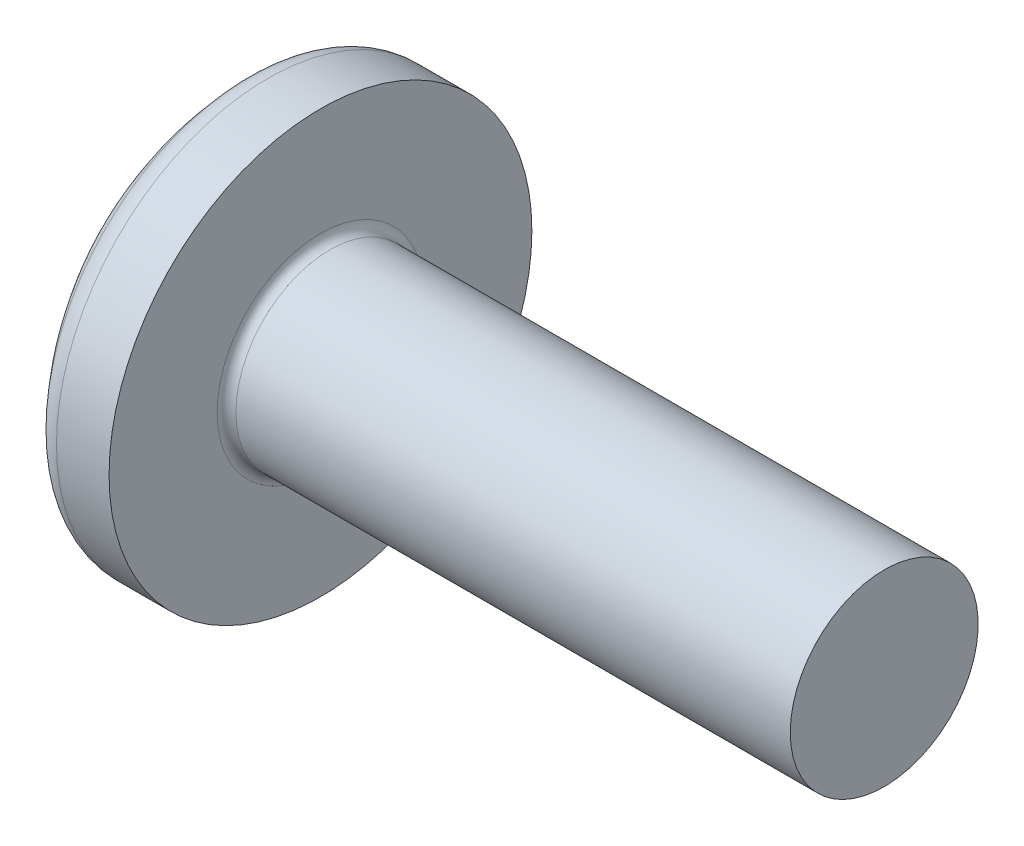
ISO-10303-21;
HEADER;
FILE_DESCRIPTION(('STEP AP214'),'2;1');
FILE_NAME('part.step','',(''),(''),'','','');
FILE_SCHEMA(('AUTOMOTIVE_DESIGN { 1 0 10303 214 1 1 1 1 }'));
ENDSEC;
DATA;
#1=APPLICATION_CONTEXT('core data for automotive mechanical design processes');
#2=APPLICATION_PROTOCOL_DEFINITION('international standard','automotive_design',2000,#1);
#3=PRODUCT_CONTEXT('',#1,'mechanical');
#4=PRODUCT('Part','Part','',(#3));
#5=PRODUCT_RELATED_PRODUCT_CATEGORY('part','',(#4));
#6=PRODUCT_DEFINITION_FORMATION('','',#4);
#7=PRODUCT_DEFINITION_CONTEXT('part definition',#1,'design');
#8=PRODUCT_DEFINITION('design','',#6,#7);
#9=PRODUCT_DEFINITION_SHAPE('','',#8);
#10=(LENGTH_UNIT() NAMED_UNIT(*) SI_UNIT(.MILLI.,.METRE.));
#11=(NAMED_UNIT(*) PLANE_ANGLE_UNIT() SI_UNIT($,.RADIAN.));
#12=(NAMED_UNIT(*) SI_UNIT($,.STERADIAN.) SOLID_ANGLE_UNIT());
#13=UNCERTAINTY_MEASURE_WITH_UNIT(LENGTH_MEASURE(1.E-05),#10,'distance_accuracy_value','');
#14=(GEOMETRIC_REPRESENTATION_CONTEXT(3) GLOBAL_UNCERTAINTY_ASSIGNED_CONTEXT((#13)) GLOBAL_UNIT_ASSIGNED_CONTEXT((#10,
#11,#12)) REPRESENTATION_CONTEXT('',''));
#15=CARTESIAN_POINT('',(0.,0.,0.));
#16=DIRECTION('',(0.,0.,1.));
#17=DIRECTION('',(1.,0.,0.));
#18=AXIS2_PLACEMENT_3D('',#15,#16,#17);
#19=CARTESIAN_POINT('',(3.2,0.,0.));
#20=DIRECTION('',(-1.,0.,0.));
#21=DIRECTION('',(0.,1.,0.));
#22=AXIS2_PLACEMENT_3D('',#19,#20,#21);
#23=SPHERICAL_SURFACE('',#22,3.2);
#24=CARTESIAN_POINT('',(0.841233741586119,0.,0.));
#25=DIRECTION('',(-1.,0.,0.));
#26=DIRECTION('',(0.,0.,1.));
#27=AXIS2_PLACEMENT_3D('',#24,#25,#26);
#28=CIRCLE('',#27,2.16245733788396);
#29=CARTESIAN_POINT('',(0.841233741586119,0.,2.16245733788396));
#30=VERTEX_POINT('',#29);
#31=EDGE_CURVE('E237',#30,#30,#28,.T.);
#32=ORIENTED_EDGE('',*,*,#31,.T.);
#33=EDGE_LOOP('',(#32));
#34=FACE_BOUND('',#33,.T.);
#35=CARTESIAN_POINT('',(0.0716483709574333,0.,0.));
#36=DIRECTION('',(1.,0.,0.));
#37=DIRECTION('',(0.,0.,-1.));
#38=AXIS2_PLACEMENT_3D('',#35,#36,#37);
#39=CIRCLE('',#38,0.673361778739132);
#40=CARTESIAN_POINT('',(0.0716483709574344,-0.369999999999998,-0.562597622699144));
#41=VERTEX_POINT('',#40);
#42=CARTESIAN_POINT('',(0.0716483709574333,-0.56259762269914,-0.37));
#43=VERTEX_POINT('',#42);
#44=EDGE_CURVE('E373',#41,#43,#39,.F.);
#45=ORIENTED_EDGE('',*,*,#44,.F.);
#46=CARTESIAN_POINT('',(3.2,-0.37,0.));
#47=DIRECTION('',(0.,1.,0.));
#48=DIRECTION('',(0.,0.,1.));
#49=AXIS2_PLACEMENT_3D('',#46,#47,#48);
#50=CIRCLE('',#49,3.17853739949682);
#51=CARTESIAN_POINT('',(0.155263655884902,-0.369999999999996,-0.912513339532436));
#52=VERTEX_POINT('',#51);
#53=EDGE_CURVE('E299',#52,#41,#50,.T.);
#54=ORIENTED_EDGE('',*,*,#53,.F.);
#55=CARTESIAN_POINT('',(3.24047110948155,0.,-0.16762475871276));
#56=DIRECTION('',(0.234695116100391,0.,-0.972069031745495));
#57=DIRECTION('',(-0.972069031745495,0.,-0.234695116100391));
#58=AXIS2_PLACEMENT_3D('',#55,#56,#57);
#59=CIRCLE('',#58,3.19535037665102);
#60=CARTESIAN_POINT('',(0.155263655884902,0.370000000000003,-0.912513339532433));
#61=VERTEX_POINT('',#60);
#62=EDGE_CURVE('E271',#52,#61,#59,.T.);
#63=ORIENTED_EDGE('',*,*,#62,.T.);
#64=CARTESIAN_POINT('',(3.2,0.37,0.));
#65=DIRECTION('',(0.,-1.,0.));
#66=DIRECTION('',(0.,0.,-1.));
#67=AXIS2_PLACEMENT_3D('',#64,#65,#66);
#68=CIRCLE('',#67,3.17853739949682);
#69=CARTESIAN_POINT('',(0.0716483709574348,0.370000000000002,-0.562597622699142));
#70=VERTEX_POINT('',#69);
#71=EDGE_CURVE('E326',#70,#61,#68,.T.);
#72=ORIENTED_EDGE('',*,*,#71,.F.);
#73=CARTESIAN_POINT('',(0.0716483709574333,0.562597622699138,-0.37));
#74=VERTEX_POINT('',#73);
#75=EDGE_CURVE('E392',#74,#70,#39,.F.);
#76=ORIENTED_EDGE('',*,*,#75,.F.);
#77=CARTESIAN_POINT('',(3.2,0.,-0.37));
#78=DIRECTION('',(0.,0.,1.));
#79=DIRECTION('',(0.,-1.,0.));
#80=AXIS2_PLACEMENT_3D('',#77,#78,#79);
#81=CIRCLE('',#80,3.17853739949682);
#82=CARTESIAN_POINT('',(0.155263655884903,0.912513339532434,-0.37));
#83=VERTEX_POINT('',#82);
#84=EDGE_CURVE('E265',#83,#74,#81,.T.);
#85=ORIENTED_EDGE('',*,*,#84,.F.);
#86=CARTESIAN_POINT('',(3.24047110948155,0.167624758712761,0.));
#87=DIRECTION('',(0.234695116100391,0.972069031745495,0.));
#88=DIRECTION('',(-0.972069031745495,0.234695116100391,0.));
#89=AXIS2_PLACEMENT_3D('',#86,#87,#88);
#90=CIRCLE('',#89,3.19535037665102);
#91=CARTESIAN_POINT('',(0.155263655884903,0.912513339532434,0.37));
#92=VERTEX_POINT('',#91);
#93=EDGE_CURVE('E268',#83,#92,#90,.T.);
#94=ORIENTED_EDGE('',*,*,#93,.T.);
#95=CARTESIAN_POINT('',(3.2,0.,0.37));
#96=DIRECTION('',(0.,0.,-1.));
#97=DIRECTION('',(0.,1.,0.));
#98=AXIS2_PLACEMENT_3D('',#95,#96,#97);
#99=CIRCLE('',#98,3.17853739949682);
#100=CARTESIAN_POINT('',(0.0716483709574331,0.562597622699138,0.37));
#101=VERTEX_POINT('',#100);
#102=EDGE_CURVE('E261',#101,#92,#99,.T.);
#103=ORIENTED_EDGE('',*,*,#102,.F.);
#104=CARTESIAN_POINT('',(0.0716483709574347,0.369999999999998,0.562597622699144));
#105=VERTEX_POINT('',#104);
#106=EDGE_CURVE('E391',#105,#101,#39,.F.);
#107=ORIENTED_EDGE('',*,*,#106,.F.);
#108=CARTESIAN_POINT('',(0.155263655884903,0.369999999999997,0.912513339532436));
#109=VERTEX_POINT('',#108);
#110=EDGE_CURVE('E281',#109,#105,#68,.T.);
#111=ORIENTED_EDGE('',*,*,#110,.F.);
#112=CARTESIAN_POINT('',(3.24047110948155,0.,0.167624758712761));
#113=DIRECTION('',(0.234695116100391,0.,0.972069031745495));
#114=DIRECTION('',(0.972069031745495,0.,-0.234695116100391));
#115=AXIS2_PLACEMENT_3D('',#112,#113,#114);
#116=CIRCLE('',#115,3.19535037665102);
#117=CARTESIAN_POINT('',(0.155263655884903,-0.370000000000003,0.912513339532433));
#118=VERTEX_POINT('',#117);
#119=EDGE_CURVE('E48',#109,#118,#116,.T.);
#120=ORIENTED_EDGE('',*,*,#119,.T.);
#121=CARTESIAN_POINT('',(0.0716483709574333,-0.370000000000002,0.562597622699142));
#122=VERTEX_POINT('',#121);
#123=EDGE_CURVE('E278',#122,#118,#50,.T.);
#124=ORIENTED_EDGE('',*,*,#123,.F.);
#125=CARTESIAN_POINT('',(0.0716483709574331,-0.562597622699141,0.37));
#126=VERTEX_POINT('',#125);
#127=EDGE_CURVE('E431',#126,#122,#39,.F.);
#128=ORIENTED_EDGE('',*,*,#127,.F.);
#129=CARTESIAN_POINT('',(0.155263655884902,-0.912513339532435,0.37));
#130=VERTEX_POINT('',#129);
#131=EDGE_CURVE('E262',#130,#126,#99,.T.);
#132=ORIENTED_EDGE('',*,*,#131,.F.);
#133=CARTESIAN_POINT('',(3.24047110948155,-0.16762475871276,0.));
#134=DIRECTION('',(0.234695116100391,-0.972069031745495,0.));
#135=DIRECTION('',(0.972069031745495,0.234695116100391,0.));
#136=AXIS2_PLACEMENT_3D('',#133,#134,#135);
#137=CIRCLE('',#136,3.19535037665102);
#138=CARTESIAN_POINT('',(0.155263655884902,-0.912513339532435,-0.37));
#139=VERTEX_POINT('',#138);
#140=EDGE_CURVE('E258',#130,#139,#137,.T.);
#141=ORIENTED_EDGE('',*,*,#140,.T.);
#142=EDGE_CURVE('E63',#43,#139,#81,.T.);
#143=ORIENTED_EDGE('',*,*,#142,.F.);
#144=EDGE_LOOP('',(#45,#54,#63,#72,#76,#85,#94,#103,#107,#111,#120,#124,#128,#132,#141,#143));
#145=FACE_BOUND('',#144,.T.);
#146=ADVANCED_FACE('F34',(#34,#145),#23,.T.);
#147=CARTESIAN_POINT('',(1.75,0.527482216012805,-0.37));
#148=DIRECTION('',(0.,0.,1.));
#149=DIRECTION('',(0.,-1.,0.));
#150=AXIS2_PLACEMENT_3D('',#147,#148,#149);
#151=PLANE('',#150);
#152=ORIENTED_EDGE('',*,*,#84,.T.);
#153=CARTESIAN_POINT('',(-0.971955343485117,0.648166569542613,-0.37));
#154=CARTESIAN_POINT('',(-0.766872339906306,0.631647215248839,-0.37));
#155=CARTESIAN_POINT('',(-0.561800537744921,0.614985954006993,-0.37));
#156=CARTESIAN_POINT('',(-0.151684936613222,0.581268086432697,-0.37));
#157=CARTESIAN_POINT('',(0.0533588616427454,0.564211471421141,-0.37));
#158=CARTESIAN_POINT('',(0.46340379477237,0.529592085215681,-0.37));
#159=CARTESIAN_POINT('',(0.668404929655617,0.512029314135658,-0.37));
#160=CARTESIAN_POINT('',(1.07834476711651,0.476219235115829,-0.37));
#161=CARTESIAN_POINT('',(1.28328347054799,0.457971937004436,-0.37));
#162=CARTESIAN_POINT('',(1.62132593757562,0.427064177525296,-0.37));
#163=CARTESIAN_POINT('',(1.75445532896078,0.414684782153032,-0.37));
#164=CARTESIAN_POINT('',(2.0206619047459,0.38938526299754,-0.37));
#165=CARTESIAN_POINT('',(2.15373908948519,0.376465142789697,-0.37));
#166=CARTESIAN_POINT('',(2.41982964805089,0.349910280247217,-0.37));
#167=CARTESIAN_POINT('',(2.55284301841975,0.336275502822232,-0.37));
#168=CARTESIAN_POINT('',(2.81875830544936,0.307934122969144,-0.37));
#169=CARTESIAN_POINT('',(2.95166021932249,0.293227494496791,-0.37));
#170=CARTESIAN_POINT('',(3.08448262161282,0.277806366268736,-0.37));
#171=B_SPLINE_CURVE_WITH_KNOTS('',3,(#153,#154,#155,#156,#157,#158,#159,#160,#161,#162,#163,
#164,#165,#166,#167,#168,#169,#170),.UNSPECIFIED.,.F.,.F.,(4,2,2,2,2,2,2,2,4),(0.,
0.617242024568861,1.23449761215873,1.85175306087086,2.46899965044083,2.87010992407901,
3.27121754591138,3.67234488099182,4.07348196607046),.UNSPECIFIED.);
#172=CARTESIAN_POINT('',(1.75,0.415013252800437,-0.370000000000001));
#173=VERTEX_POINT('',#172);
#174=EDGE_CURVE('E415',#74,#173,#171,.T.);
#175=ORIENTED_EDGE('',*,*,#174,.T.);
#176=DIRECTION('',(0.,1.,0.));
#177=VECTOR('',#176,1.);
#178=CARTESIAN_POINT('',(1.75,-0.527482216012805,-0.37));
#179=LINE('',#178,#177);
#180=CARTESIAN_POINT('',(1.75,0.527482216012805,-0.37));
#181=VERTEX_POINT('',#180);
#182=EDGE_CURVE('E355',#173,#181,#179,.T.);
#183=ORIENTED_EDGE('',*,*,#182,.T.);
#184=DIRECTION('',(0.972069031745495,-0.234695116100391,0.));
#185=VECTOR('',#184,1.);
#186=CARTESIAN_POINT('',(0.,0.95,-0.37));
#187=LINE('',#186,#185);
#188=EDGE_CURVE('E238',#83,#181,#187,.T.);
#189=ORIENTED_EDGE('',*,*,#188,.F.);
#190=EDGE_LOOP('',(#152,#175,#183,#189));
#191=FACE_BOUND('',#190,.T.);
#192=ADVANCED_FACE('F193',(#191),#151,.T.);
#193=CARTESIAN_POINT('',(1.75,-0.527482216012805,-0.37));
#194=VERTEX_POINT('',#193);
#195=CARTESIAN_POINT('',(1.75,-0.415013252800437,-0.37));
#196=VERTEX_POINT('',#195);
#197=EDGE_CURVE('E246',#194,#196,#179,.T.);
#198=ORIENTED_EDGE('',*,*,#197,.T.);
#199=CARTESIAN_POINT('',(-0.971955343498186,-0.648166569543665,-0.37));
#200=CARTESIAN_POINT('',(-0.766872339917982,-0.631647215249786,-0.37));
#201=CARTESIAN_POINT('',(-0.561800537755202,-0.614985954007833,-0.37));
#202=CARTESIAN_POINT('',(-0.151684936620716,-0.581268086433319,-0.37));
#203=CARTESIAN_POINT('',(0.0533588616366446,-0.564211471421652,-0.37));
#204=CARTESIAN_POINT('',(0.463403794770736,-0.529592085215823,-0.37));
#205=CARTESIAN_POINT('',(0.668404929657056,-0.512029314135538,-0.37));
#206=CARTESIAN_POINT('',(1.0783447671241,-0.476219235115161,-0.37));
#207=CARTESIAN_POINT('',(1.28328347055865,-0.457971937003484,-0.37));
#208=CARTESIAN_POINT('',(1.62132593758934,-0.427064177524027,-0.37));
#209=CARTESIAN_POINT('',(1.75445532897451,-0.414684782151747,-0.37));
#210=CARTESIAN_POINT('',(2.02066190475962,-0.389385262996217,-0.37));
#211=CARTESIAN_POINT('',(2.15373908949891,-0.376465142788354,-0.37));
#212=CARTESIAN_POINT('',(2.4198296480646,-0.349910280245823,-0.37));
#213=CARTESIAN_POINT('',(2.55284301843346,-0.336275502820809,-0.37));
#214=CARTESIAN_POINT('',(2.81875830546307,-0.307934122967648,-0.37));
#215=CARTESIAN_POINT('',(2.95166021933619,-0.293227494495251,-0.37));
#216=CARTESIAN_POINT('',(3.08448262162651,-0.277806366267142,-0.37));
#217=B_SPLINE_CURVE_WITH_KNOTS('',3,(#199,#200,#201,#202,#203,#204,#205,#206,#207,#208,#209,
#210,#211,#212,#213,#214,#215,#216),.UNSPECIFIED.,.F.,.F.,(4,2,2,2,2,2,2,2,4),(0.,
0.617242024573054,1.23449761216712,1.8517530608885,2.46899965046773,2.8701099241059,
3.27121754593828,3.67234488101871,4.07348196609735),.UNSPECIFIED.);
#218=EDGE_CURVE('E390',#196,#43,#217,.F.);
#219=ORIENTED_EDGE('',*,*,#218,.T.);
#220=ORIENTED_EDGE('',*,*,#142,.T.);
#221=DIRECTION('',(0.972069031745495,0.234695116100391,0.));
#222=VECTOR('',#221,1.);
#223=CARTESIAN_POINT('',(0.,-0.95,-0.37));
#224=LINE('',#223,#222);
#225=EDGE_CURVE('E329',#139,#194,#224,.T.);
#226=ORIENTED_EDGE('',*,*,#225,.T.);
#227=EDGE_LOOP('',(#198,#219,#220,#226));
#228=FACE_BOUND('',#227,.T.);
#229=ADVANCED_FACE('F199',(#228),#151,.T.);
#230=CARTESIAN_POINT('',(0.,-0.95,0.37));
#231=DIRECTION('',(0.,0.,-1.));
#232=DIRECTION('',(0.,1.,0.));
#233=AXIS2_PLACEMENT_3D('',#230,#231,#232);
#234=PLANE('',#233);
#235=DIRECTION('',(0.,-1.,0.));
#236=VECTOR('',#235,1.);
#237=CARTESIAN_POINT('',(1.75,0.527482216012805,0.37));
#238=LINE('',#237,#236);
#239=CARTESIAN_POINT('',(1.75,0.527482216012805,0.37));
#240=VERTEX_POINT('',#239);
#241=CARTESIAN_POINT('',(1.75,0.415013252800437,0.37));
#242=VERTEX_POINT('',#241);
#243=EDGE_CURVE('E338',#240,#242,#238,.T.);
#244=ORIENTED_EDGE('',*,*,#243,.T.);
#245=CARTESIAN_POINT('',(-0.971955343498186,0.648166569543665,0.37));
#246=CARTESIAN_POINT('',(-0.766872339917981,0.631647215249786,0.37));
#247=CARTESIAN_POINT('',(-0.561800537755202,0.614985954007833,0.37));
#248=CARTESIAN_POINT('',(-0.151684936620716,0.581268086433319,0.37));
#249=CARTESIAN_POINT('',(0.0533588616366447,0.564211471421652,0.37));
#250=CARTESIAN_POINT('',(0.463403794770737,0.529592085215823,0.37));
#251=CARTESIAN_POINT('',(0.668404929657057,0.512029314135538,0.37));
#252=CARTESIAN_POINT('',(1.0783447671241,0.476219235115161,0.37));
#253=CARTESIAN_POINT('',(1.28328347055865,0.457971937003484,0.37));
#254=CARTESIAN_POINT('',(1.62132593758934,0.427064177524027,0.37));
#255=CARTESIAN_POINT('',(1.75445532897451,0.414684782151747,0.37));
#256=CARTESIAN_POINT('',(2.02066190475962,0.389385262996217,0.37));
#257=CARTESIAN_POINT('',(2.15373908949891,0.376465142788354,0.37));
#258=CARTESIAN_POINT('',(2.4198296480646,0.349910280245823,0.37));
#259=CARTESIAN_POINT('',(2.55284301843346,0.336275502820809,0.37));
#260=CARTESIAN_POINT('',(2.81875830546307,0.307934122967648,0.37));
#261=CARTESIAN_POINT('',(2.95166021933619,0.293227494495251,0.37));
#262=CARTESIAN_POINT('',(3.08448262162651,0.277806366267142,0.37));
#263=B_SPLINE_CURVE_WITH_KNOTS('',3,(#245,#246,#247,#248,#249,#250,#251,#252,#253,#254,#255,
#256,#257,#258,#259,#260,#261,#262),.UNSPECIFIED.,.F.,.F.,(4,2,2,2,2,2,2,2,4),(0.,
0.617242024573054,1.23449761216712,1.8517530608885,2.46899965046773,2.8701099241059,
3.27121754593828,3.67234488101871,4.07348196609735),.UNSPECIFIED.);
#264=EDGE_CURVE('E668',#242,#101,#263,.F.);
#265=ORIENTED_EDGE('',*,*,#264,.T.);
#266=ORIENTED_EDGE('',*,*,#102,.T.);
#267=DIRECTION('',(0.972069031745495,-0.234695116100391,0.));
#268=VECTOR('',#267,1.);
#269=CARTESIAN_POINT('',(0.,0.95,0.37));
#270=LINE('',#269,#268);
#271=EDGE_CURVE('E243',#92,#240,#270,.T.);
#272=ORIENTED_EDGE('',*,*,#271,.T.);
#273=EDGE_LOOP('',(#244,#265,#266,#272));
#274=FACE_BOUND('',#273,.T.);
#275=ADVANCED_FACE('F411',(#274),#234,.T.);
#276=ORIENTED_EDGE('',*,*,#131,.T.);
#277=CARTESIAN_POINT('',(-0.971955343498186,-0.648166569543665,0.37));
#278=CARTESIAN_POINT('',(-0.766872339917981,-0.631647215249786,0.37));
#279=CARTESIAN_POINT('',(-0.561800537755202,-0.614985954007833,0.37));
#280=CARTESIAN_POINT('',(-0.151684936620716,-0.581268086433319,0.37));
#281=CARTESIAN_POINT('',(0.0533588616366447,-0.564211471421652,0.37));
#282=CARTESIAN_POINT('',(0.463403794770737,-0.529592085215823,0.37));
#283=CARTESIAN_POINT('',(0.668404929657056,-0.512029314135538,0.37));
#284=CARTESIAN_POINT('',(1.0783447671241,-0.476219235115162,0.37));
#285=CARTESIAN_POINT('',(1.28328347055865,-0.457971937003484,0.37));
#286=CARTESIAN_POINT('',(1.62132593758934,-0.427064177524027,0.37));
#287=CARTESIAN_POINT('',(1.75445532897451,-0.414684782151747,0.37));
#288=CARTESIAN_POINT('',(2.02066190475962,-0.389385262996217,0.37));
#289=CARTESIAN_POINT('',(2.15373908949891,-0.376465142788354,0.37));
#290=CARTESIAN_POINT('',(2.4198296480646,-0.349910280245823,0.37));
#291=CARTESIAN_POINT('',(2.55284301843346,-0.336275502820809,0.37));
#292=CARTESIAN_POINT('',(2.81875830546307,-0.307934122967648,0.37));
#293=CARTESIAN_POINT('',(2.95166021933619,-0.293227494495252,0.37));
#294=CARTESIAN_POINT('',(3.08448262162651,-0.277806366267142,0.37));
#295=B_SPLINE_CURVE_WITH_KNOTS('',3,(#277,#278,#279,#280,#281,#282,#283,#284,#285,#286,#287,
#288,#289,#290,#291,#292,#293,#294),.UNSPECIFIED.,.F.,.F.,(4,2,2,2,2,2,2,2,4),(0.,
0.617242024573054,1.23449761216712,1.8517530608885,2.46899965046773,2.8701099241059,
3.27121754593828,3.67234488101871,4.07348196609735),.UNSPECIFIED.);
#296=CARTESIAN_POINT('',(1.75,-0.415013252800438,0.37));
#297=VERTEX_POINT('',#296);
#298=EDGE_CURVE('E432',#126,#297,#295,.T.);
#299=ORIENTED_EDGE('',*,*,#298,.T.);
#300=CARTESIAN_POINT('',(1.75,-0.527482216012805,0.37));
#301=VERTEX_POINT('',#300);
#302=EDGE_CURVE('E340',#297,#301,#238,.T.);
#303=ORIENTED_EDGE('',*,*,#302,.T.);
#304=DIRECTION('',(0.972069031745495,0.234695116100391,0.));
#305=VECTOR('',#304,1.);
#306=CARTESIAN_POINT('',(0.,-0.95,0.37));
#307=LINE('',#306,#305);
#308=EDGE_CURVE('E331',#130,#301,#307,.T.);
#309=ORIENTED_EDGE('',*,*,#308,.F.);
#310=EDGE_LOOP('',(#276,#299,#303,#309));
#311=FACE_BOUND('',#310,.T.);
#312=ADVANCED_FACE('F524',(#311),#234,.T.);
#313=CARTESIAN_POINT('',(1.75,0.527482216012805,0.37));
#314=DIRECTION('',(0.234695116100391,0.972069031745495,0.));
#315=DIRECTION('',(-0.972069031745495,0.234695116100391,0.));
#316=AXIS2_PLACEMENT_3D('',#313,#314,#315);
#317=PLANE('',#316);
#318=CARTESIAN_POINT('',(3.40675133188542,0.127478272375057,0.));
#319=DIRECTION('',(0.234695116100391,0.972069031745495,0.));
#320=DIRECTION('',(-0.972069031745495,0.234695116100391,0.));
#321=AXIS2_PLACEMENT_3D('',#318,#319,#320);
#322=ELLIPSE('',#321,1.87540613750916,0.421283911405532);
#323=CARTESIAN_POINT('',(1.75,0.527482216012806,0.175779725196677));
#324=VERTEX_POINT('',#323);
#325=CARTESIAN_POINT('',(1.75,0.527482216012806,-0.175779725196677));
#326=VERTEX_POINT('',#325);
#327=EDGE_CURVE('E304',#324,#326,#322,.F.);
#328=ORIENTED_EDGE('',*,*,#327,.F.);
#329=DIRECTION('',(0.,0.,-1.));
#330=VECTOR('',#329,1.);
#331=CARTESIAN_POINT('',(1.75,0.527482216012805,0.37));
#332=LINE('',#331,#330);
#333=EDGE_CURVE('E341',#240,#324,#332,.T.);
#334=ORIENTED_EDGE('',*,*,#333,.F.);
#335=ORIENTED_EDGE('',*,*,#271,.F.);
#336=ORIENTED_EDGE('',*,*,#93,.F.);
#337=ORIENTED_EDGE('',*,*,#188,.T.);
#338=EDGE_CURVE('E343',#326,#181,#332,.T.);
#339=ORIENTED_EDGE('',*,*,#338,.F.);
#340=EDGE_LOOP('',(#328,#334,#335,#336,#337,#339));
#341=FACE_BOUND('',#340,.T.);
#342=ADVANCED_FACE('F409',(#341),#317,.F.);
#343=CARTESIAN_POINT('',(1.75,-0.527482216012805,-0.37));
#344=DIRECTION('',(0.234695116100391,-0.972069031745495,0.));
#345=DIRECTION('',(0.972069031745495,0.234695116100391,0.));
#346=AXIS2_PLACEMENT_3D('',#343,#344,#345);
#347=PLANE('',#346);
#348=CARTESIAN_POINT('',(3.40675133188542,-0.127478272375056,0.));
#349=DIRECTION('',(0.234695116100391,-0.972069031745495,0.));
#350=DIRECTION('',(-0.972069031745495,-0.234695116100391,0.));
#351=AXIS2_PLACEMENT_3D('',#348,#349,#350);
#352=ELLIPSE('',#351,1.87540613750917,0.421283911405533);
#353=CARTESIAN_POINT('',(1.75,-0.527482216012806,-0.175779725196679));
#354=VERTEX_POINT('',#353);
#355=CARTESIAN_POINT('',(1.75,-0.527482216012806,0.175779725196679));
#356=VERTEX_POINT('',#355);
#357=EDGE_CURVE('E670',#354,#356,#352,.F.);
#358=ORIENTED_EDGE('',*,*,#357,.F.);
#359=DIRECTION('',(0.,0.,1.));
#360=VECTOR('',#359,1.);
#361=CARTESIAN_POINT('',(1.75,-0.527482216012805,-0.37));
#362=LINE('',#361,#360);
#363=EDGE_CURVE('E334',#194,#354,#362,.T.);
#364=ORIENTED_EDGE('',*,*,#363,.F.);
#365=ORIENTED_EDGE('',*,*,#225,.F.);
#366=ORIENTED_EDGE('',*,*,#140,.F.);
#367=ORIENTED_EDGE('',*,*,#308,.T.);
#368=EDGE_CURVE('E337',#356,#301,#362,.T.);
#369=ORIENTED_EDGE('',*,*,#368,.F.);
#370=EDGE_LOOP('',(#358,#364,#365,#366,#367,#369));
#371=FACE_BOUND('',#370,.T.);
#372=ADVANCED_FACE('F511',(#371),#347,.F.);
#373=CARTESIAN_POINT('',(1.75,0.527482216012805,-0.37));
#374=DIRECTION('',(-1.,0.,0.));
#375=DIRECTION('',(0.,0.,1.));
#376=AXIS2_PLACEMENT_3D('',#373,#374,#375);
#377=PLANE('',#376);
#378=DIRECTION('',(0.,1.,0.));
#379=VECTOR('',#378,1.);
#380=CARTESIAN_POINT('',(1.75,-0.370000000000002,0.527482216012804));
#381=LINE('',#380,#379);
#382=CARTESIAN_POINT('',(1.75,-0.370000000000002,0.527482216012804));
#383=VERTEX_POINT('',#382);
#384=CARTESIAN_POINT('',(1.75,-0.175779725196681,0.527482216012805));
#385=VERTEX_POINT('',#384);
#386=EDGE_CURVE('E319',#383,#385,#381,.T.);
#387=ORIENTED_EDGE('',*,*,#386,.T.);
#388=CARTESIAN_POINT('',(1.75,0.,0.));
#389=DIRECTION('',(-1.,0.,0.));
#390=DIRECTION('',(0.,0.,1.));
#391=AXIS2_PLACEMENT_3D('',#388,#389,#390);
#392=CIRCLE('',#391,0.556);
#393=CARTESIAN_POINT('',(1.75,-0.370000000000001,0.415013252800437));
#394=VERTEX_POINT('',#393);
#395=EDGE_CURVE('E698',#394,#385,#392,.T.);
#396=ORIENTED_EDGE('',*,*,#395,.F.);
#397=DIRECTION('',(0.,0.,-1.));
#398=VECTOR('',#397,1.);
#399=CARTESIAN_POINT('',(1.75,-0.370000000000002,0.527482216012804));
#400=LINE('',#399,#398);
#401=EDGE_CURVE('E315',#383,#394,#400,.T.);
#402=ORIENTED_EDGE('',*,*,#401,.F.);
#403=EDGE_LOOP('',(#387,#396,#402));
#404=FACE_BOUND('',#403,.T.);
#405=ADVANCED_FACE('F468',(#404),#377,.T.);
#406=ORIENTED_EDGE('',*,*,#302,.F.);
#407=EDGE_CURVE('E703',#356,#297,#392,.T.);
#408=ORIENTED_EDGE('',*,*,#407,.F.);
#409=ORIENTED_EDGE('',*,*,#368,.T.);
#410=EDGE_LOOP('',(#406,#408,#409));
#411=FACE_BOUND('',#410,.T.);
#412=ADVANCED_FACE('F498',(#411),#377,.T.);
#413=ORIENTED_EDGE('',*,*,#363,.T.);
#414=EDGE_CURVE('E384',#196,#354,#392,.T.);
#415=ORIENTED_EDGE('',*,*,#414,.F.);
#416=ORIENTED_EDGE('',*,*,#197,.F.);
#417=EDGE_LOOP('',(#413,#415,#416));
#418=FACE_BOUND('',#417,.T.);
#419=ADVANCED_FACE('F492',(#418),#377,.T.);
#420=CARTESIAN_POINT('',(1.75,-0.369999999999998,-0.415013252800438));
#421=VERTEX_POINT('',#420);
#422=CARTESIAN_POINT('',(1.75,-0.369999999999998,-0.527482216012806));
#423=VERTEX_POINT('',#422);
#424=EDGE_CURVE('E318',#421,#423,#400,.T.);
#425=ORIENTED_EDGE('',*,*,#424,.F.);
#426=CARTESIAN_POINT('',(1.75,-0.175779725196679,-0.527482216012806));
#427=VERTEX_POINT('',#426);
#428=EDGE_CURVE('E55',#427,#421,#392,.T.);
#429=ORIENTED_EDGE('',*,*,#428,.F.);
#430=DIRECTION('',(0.,-1.,0.));
#431=VECTOR('',#430,1.);
#432=CARTESIAN_POINT('',(1.75,0.370000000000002,-0.527482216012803));
#433=LINE('',#432,#431);
#434=EDGE_CURVE('E314',#427,#423,#433,.T.);
#435=ORIENTED_EDGE('',*,*,#434,.T.);
#436=EDGE_LOOP('',(#425,#429,#435));
#437=FACE_BOUND('',#436,.T.);
#438=ADVANCED_FACE('F379',(#437),#377,.T.);
#439=CARTESIAN_POINT('',(1.75,0.370000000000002,-0.527482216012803));
#440=VERTEX_POINT('',#439);
#441=CARTESIAN_POINT('',(1.75,0.175779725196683,-0.527482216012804));
#442=VERTEX_POINT('',#441);
#443=EDGE_CURVE('E311',#440,#442,#433,.T.);
#444=ORIENTED_EDGE('',*,*,#443,.T.);
#445=CARTESIAN_POINT('',(1.75,0.370000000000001,-0.415013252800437));
#446=VERTEX_POINT('',#445);
#447=EDGE_CURVE('E383',#446,#442,#392,.T.);
#448=ORIENTED_EDGE('',*,*,#447,.F.);
#449=DIRECTION('',(0.,0.,1.));
#450=VECTOR('',#449,1.);
#451=CARTESIAN_POINT('',(1.75,0.370000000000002,-0.527482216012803));
#452=LINE('',#451,#450);
#453=EDGE_CURVE('E323',#440,#446,#452,.T.);
#454=ORIENTED_EDGE('',*,*,#453,.F.);
#455=EDGE_LOOP('',(#444,#448,#454));
#456=FACE_BOUND('',#455,.T.);
#457=ADVANCED_FACE('F480',(#456),#377,.T.);
#458=ORIENTED_EDGE('',*,*,#182,.F.);
#459=EDGE_CURVE('E687',#326,#173,#392,.T.);
#460=ORIENTED_EDGE('',*,*,#459,.F.);
#461=ORIENTED_EDGE('',*,*,#338,.T.);
#462=EDGE_LOOP('',(#458,#460,#461));
#463=FACE_BOUND('',#462,.T.);
#464=ADVANCED_FACE('F474',(#463),#377,.T.);
#465=ORIENTED_EDGE('',*,*,#333,.T.);
#466=EDGE_CURVE('E689',#242,#324,#392,.T.);
#467=ORIENTED_EDGE('',*,*,#466,.F.);
#468=ORIENTED_EDGE('',*,*,#243,.F.);
#469=EDGE_LOOP('',(#465,#467,#468));
#470=FACE_BOUND('',#469,.T.);
#471=ADVANCED_FACE('F466',(#470),#377,.T.);
#472=CARTESIAN_POINT('',(1.75,0.369999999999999,0.415013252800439));
#473=VERTEX_POINT('',#472);
#474=CARTESIAN_POINT('',(1.75,0.369999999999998,0.527482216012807));
#475=VERTEX_POINT('',#474);
#476=EDGE_CURVE('E296',#473,#475,#452,.T.);
#477=ORIENTED_EDGE('',*,*,#476,.F.);
#478=CARTESIAN_POINT('',(1.75,0.175779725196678,0.527482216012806));
#479=VERTEX_POINT('',#478);
#480=EDGE_CURVE('E385',#479,#473,#392,.T.);
#481=ORIENTED_EDGE('',*,*,#480,.F.);
#482=EDGE_CURVE('E322',#479,#475,#381,.T.);
#483=ORIENTED_EDGE('',*,*,#482,.T.);
#484=EDGE_LOOP('',(#477,#481,#483));
#485=FACE_BOUND('',#484,.T.);
#486=ADVANCED_FACE('F460',(#485),#377,.T.);
#487=CARTESIAN_POINT('',(1.75,0.369999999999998,0.527482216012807));
#488=DIRECTION('',(0.,-1.,0.));
#489=DIRECTION('',(0.,0.,-1.));
#490=AXIS2_PLACEMENT_3D('',#487,#488,#489);
#491=PLANE('',#490);
#492=ORIENTED_EDGE('',*,*,#110,.T.);
#493=CARTESIAN_POINT('',(-0.971955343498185,0.369999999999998,0.648166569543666));
#494=CARTESIAN_POINT('',(-0.766872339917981,0.369999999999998,0.631647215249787));
#495=CARTESIAN_POINT('',(-0.561800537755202,0.369999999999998,0.614985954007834));
#496=CARTESIAN_POINT('',(-0.151684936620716,0.369999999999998,0.58126808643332));
#497=CARTESIAN_POINT('',(0.0533588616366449,0.369999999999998,0.564211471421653));
#498=CARTESIAN_POINT('',(0.463403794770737,0.369999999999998,0.529592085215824));
#499=CARTESIAN_POINT('',(0.668404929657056,0.369999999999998,0.512029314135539));
#500=CARTESIAN_POINT('',(1.0783447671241,0.369999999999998,0.476219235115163));
#501=CARTESIAN_POINT('',(1.28328347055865,0.369999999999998,0.457971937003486));
#502=CARTESIAN_POINT('',(1.62132593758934,0.369999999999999,0.427064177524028));
#503=CARTESIAN_POINT('',(1.75445532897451,0.369999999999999,0.414684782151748));
#504=CARTESIAN_POINT('',(2.02066190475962,0.369999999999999,0.389385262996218));
#505=CARTESIAN_POINT('',(2.15373908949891,0.369999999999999,0.376465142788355));
#506=CARTESIAN_POINT('',(2.4198296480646,0.369999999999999,0.349910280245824));
#507=CARTESIAN_POINT('',(2.55284301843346,0.369999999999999,0.33627550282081));
#508=CARTESIAN_POINT('',(2.81875830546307,0.369999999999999,0.307934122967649));
#509=CARTESIAN_POINT('',(2.95166021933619,0.369999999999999,0.293227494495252));
#510=CARTESIAN_POINT('',(3.08448262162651,0.369999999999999,0.277806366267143));
#511=B_SPLINE_CURVE_WITH_KNOTS('',3,(#493,#494,#495,#496,#497,#498,#499,#500,#501,#502,#503,
#504,#505,#506,#507,#508,#509,#510),.UNSPECIFIED.,.F.,.F.,(4,2,2,2,2,2,2,2,4),(0.,
0.617242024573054,1.23449761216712,1.8517530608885,2.46899965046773,2.8701099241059,
3.27121754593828,3.67234488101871,4.07348196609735),.UNSPECIFIED.);
#512=EDGE_CURVE('E667',#105,#473,#511,.T.);
#513=ORIENTED_EDGE('',*,*,#512,.T.);
#514=ORIENTED_EDGE('',*,*,#476,.T.);
#515=DIRECTION('',(0.972069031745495,0.,-0.234695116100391));
#516=VECTOR('',#515,1.);
#517=CARTESIAN_POINT('',(0.,0.369999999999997,0.950000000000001));
#518=LINE('',#517,#516);
#519=EDGE_CURVE('E289',#109,#475,#518,.T.);
#520=ORIENTED_EDGE('',*,*,#519,.F.);
#521=EDGE_LOOP('',(#492,#513,#514,#520));
#522=FACE_BOUND('',#521,.T.);
#523=ADVANCED_FACE('F293',(#522),#491,.T.);
#524=CARTESIAN_POINT('',(0.,-0.369999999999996,-0.950000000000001));
#525=DIRECTION('',(0.,1.,0.));
#526=DIRECTION('',(0.,0.,1.));
#527=AXIS2_PLACEMENT_3D('',#524,#525,#526);
#528=PLANE('',#527);
#529=ORIENTED_EDGE('',*,*,#401,.T.);
#530=CARTESIAN_POINT('',(-0.971955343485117,-0.370000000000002,0.648166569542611));
#531=CARTESIAN_POINT('',(-0.766872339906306,-0.370000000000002,0.631647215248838));
#532=CARTESIAN_POINT('',(-0.561800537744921,-0.370000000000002,0.614985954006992));
#533=CARTESIAN_POINT('',(-0.151684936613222,-0.370000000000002,0.581268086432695));
#534=CARTESIAN_POINT('',(0.0533588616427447,-0.370000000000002,0.56421147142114));
#535=CARTESIAN_POINT('',(0.46340379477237,-0.370000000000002,0.529592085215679));
#536=CARTESIAN_POINT('',(0.668404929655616,-0.370000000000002,0.512029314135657));
#537=CARTESIAN_POINT('',(1.07834476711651,-0.370000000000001,0.476219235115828));
#538=CARTESIAN_POINT('',(1.28328347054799,-0.370000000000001,0.457971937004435));
#539=CARTESIAN_POINT('',(1.62132593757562,-0.370000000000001,0.427064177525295));
#540=CARTESIAN_POINT('',(1.75445532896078,-0.370000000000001,0.414684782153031));
#541=CARTESIAN_POINT('',(2.0206619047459,-0.370000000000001,0.389385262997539));
#542=CARTESIAN_POINT('',(2.15373908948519,-0.370000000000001,0.376465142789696));
#543=CARTESIAN_POINT('',(2.41982964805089,-0.370000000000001,0.349910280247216));
#544=CARTESIAN_POINT('',(2.55284301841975,-0.370000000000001,0.336275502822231));
#545=CARTESIAN_POINT('',(2.81875830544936,-0.370000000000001,0.307934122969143));
#546=CARTESIAN_POINT('',(2.95166021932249,-0.370000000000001,0.29322749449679));
#547=CARTESIAN_POINT('',(3.08448262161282,-0.370000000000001,0.277806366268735));
#548=B_SPLINE_CURVE_WITH_KNOTS('',3,(#530,#531,#532,#533,#534,#535,#536,#537,#538,#539,#540,
#541,#542,#543,#544,#545,#546,#547),.UNSPECIFIED.,.F.,.F.,(4,2,2,2,2,2,2,2,4),(0.,
0.617242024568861,1.23449761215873,1.85175306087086,2.46899965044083,2.87010992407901,
3.27121754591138,3.67234488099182,4.07348196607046),.UNSPECIFIED.);
#549=EDGE_CURVE('E424',#394,#122,#548,.F.);
#550=ORIENTED_EDGE('',*,*,#549,.T.);
#551=ORIENTED_EDGE('',*,*,#123,.T.);
#552=DIRECTION('',(0.972069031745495,0.,-0.234695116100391));
#553=VECTOR('',#552,1.);
#554=CARTESIAN_POINT('',(0.,-0.370000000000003,0.949999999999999));
#555=LINE('',#554,#553);
#556=EDGE_CURVE('E291',#118,#383,#555,.T.);
#557=ORIENTED_EDGE('',*,*,#556,.T.);
#558=EDGE_LOOP('',(#529,#550,#551,#557));
#559=FACE_BOUND('',#558,.T.);
#560=ADVANCED_FACE('F228',(#559),#528,.T.);
#561=CARTESIAN_POINT('',(1.75,-0.370000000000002,0.527482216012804));
#562=DIRECTION('',(0.234695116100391,0.,0.972069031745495));
#563=DIRECTION('',(-0.972069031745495,0.,0.234695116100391));
#564=AXIS2_PLACEMENT_3D('',#561,#562,#563);
#565=PLANE('',#564);
#566=CARTESIAN_POINT('',(3.40675133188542,0.,0.127478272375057));
#567=DIRECTION('',(0.234695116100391,0.,0.972069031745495));
#568=DIRECTION('',(-0.972069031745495,0.,0.234695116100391));
#569=AXIS2_PLACEMENT_3D('',#566,#567,#568);
#570=ELLIPSE('',#569,1.87540613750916,0.421283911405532);
#571=EDGE_CURVE('E422',#385,#479,#570,.F.);
#572=ORIENTED_EDGE('',*,*,#571,.F.);
#573=ORIENTED_EDGE('',*,*,#386,.F.);
#574=ORIENTED_EDGE('',*,*,#556,.F.);
#575=ORIENTED_EDGE('',*,*,#119,.F.);
#576=ORIENTED_EDGE('',*,*,#519,.T.);
#577=ORIENTED_EDGE('',*,*,#482,.F.);
#578=EDGE_LOOP('',(#572,#573,#574,#575,#576,#577));
#579=FACE_BOUND('',#578,.T.);
#580=ADVANCED_FACE('F287',(#579),#565,.F.);
#581=CARTESIAN_POINT('',(1.75,0.370000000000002,-0.527482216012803));
#582=DIRECTION('',(0.234695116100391,0.,-0.972069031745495));
#583=DIRECTION('',(0.972069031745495,0.,0.234695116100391));
#584=AXIS2_PLACEMENT_3D('',#581,#582,#583);
#585=PLANE('',#584);
#586=CARTESIAN_POINT('',(3.40675133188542,0.,-0.127478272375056));
#587=DIRECTION('',(0.234695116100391,0.,-0.972069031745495));
#588=DIRECTION('',(-0.972069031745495,0.,-0.234695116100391));
#589=AXIS2_PLACEMENT_3D('',#586,#587,#588);
#590=ELLIPSE('',#589,1.87540613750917,0.421283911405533);
#591=EDGE_CURVE('E377',#442,#427,#590,.F.);
#592=ORIENTED_EDGE('',*,*,#591,.F.);
#593=ORIENTED_EDGE('',*,*,#443,.F.);
#594=DIRECTION('',(0.972069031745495,0.,0.234695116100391));
#595=VECTOR('',#594,1.);
#596=CARTESIAN_POINT('',(0.,0.370000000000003,-0.949999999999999));
#597=LINE('',#596,#595);
#598=EDGE_CURVE('E301',#61,#440,#597,.T.);
#599=ORIENTED_EDGE('',*,*,#598,.F.);
#600=ORIENTED_EDGE('',*,*,#62,.F.);
#601=DIRECTION('',(0.972069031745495,0.,0.234695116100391));
#602=VECTOR('',#601,1.);
#603=CARTESIAN_POINT('',(0.,-0.369999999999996,-0.950000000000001));
#604=LINE('',#603,#602);
#605=EDGE_CURVE('E308',#52,#423,#604,.T.);
#606=ORIENTED_EDGE('',*,*,#605,.T.);
#607=ORIENTED_EDGE('',*,*,#434,.F.);
#608=EDGE_LOOP('',(#592,#593,#599,#600,#606,#607));
#609=FACE_BOUND('',#608,.T.);
#610=ADVANCED_FACE('F368',(#609),#585,.F.);
#611=ORIENTED_EDGE('',*,*,#453,.T.);
#612=CARTESIAN_POINT('',(-0.971955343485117,0.370000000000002,-0.648166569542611));
#613=CARTESIAN_POINT('',(-0.766872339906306,0.370000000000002,-0.631647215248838));
#614=CARTESIAN_POINT('',(-0.561800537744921,0.370000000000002,-0.614985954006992));
#615=CARTESIAN_POINT('',(-0.151684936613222,0.370000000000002,-0.581268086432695));
#616=CARTESIAN_POINT('',(0.0533588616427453,0.370000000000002,-0.56421147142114));
#617=CARTESIAN_POINT('',(0.46340379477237,0.370000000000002,-0.529592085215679));
#618=CARTESIAN_POINT('',(0.668404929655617,0.370000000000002,-0.512029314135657));
#619=CARTESIAN_POINT('',(1.07834476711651,0.370000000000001,-0.476219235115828));
#620=CARTESIAN_POINT('',(1.28328347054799,0.370000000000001,-0.457971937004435));
#621=CARTESIAN_POINT('',(1.62132593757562,0.370000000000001,-0.427064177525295));
#622=CARTESIAN_POINT('',(1.75445532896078,0.370000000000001,-0.414684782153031));
#623=CARTESIAN_POINT('',(2.0206619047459,0.370000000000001,-0.389385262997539));
#624=CARTESIAN_POINT('',(2.15373908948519,0.370000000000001,-0.376465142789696));
#625=CARTESIAN_POINT('',(2.41982964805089,0.370000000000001,-0.349910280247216));
#626=CARTESIAN_POINT('',(2.55284301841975,0.370000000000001,-0.336275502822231));
#627=CARTESIAN_POINT('',(2.81875830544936,0.370000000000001,-0.307934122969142));
#628=CARTESIAN_POINT('',(2.95166021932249,0.370000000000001,-0.29322749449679));
#629=CARTESIAN_POINT('',(3.08448262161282,0.370000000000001,-0.277806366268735));
#630=B_SPLINE_CURVE_WITH_KNOTS('',3,(#612,#613,#614,#615,#616,#617,#618,#619,#620,#621,#622,
#623,#624,#625,#626,#627,#628,#629),.UNSPECIFIED.,.F.,.F.,(4,2,2,2,2,2,2,2,4),(0.,
0.617242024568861,1.23449761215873,1.85175306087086,2.46899965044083,2.87010992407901,
3.27121754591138,3.67234488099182,4.07348196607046),.UNSPECIFIED.);
#631=EDGE_CURVE('E364',#446,#70,#630,.F.);
#632=ORIENTED_EDGE('',*,*,#631,.T.);
#633=ORIENTED_EDGE('',*,*,#71,.T.);
#634=ORIENTED_EDGE('',*,*,#598,.T.);
#635=EDGE_LOOP('',(#611,#632,#633,#634));
#636=FACE_BOUND('',#635,.T.);
#637=ADVANCED_FACE('F226',(#636),#491,.T.);
#638=ORIENTED_EDGE('',*,*,#53,.T.);
#639=CARTESIAN_POINT('',(-0.971955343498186,-0.369999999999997,-0.648166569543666));
#640=CARTESIAN_POINT('',(-0.766872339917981,-0.369999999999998,-0.631647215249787));
#641=CARTESIAN_POINT('',(-0.561800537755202,-0.369999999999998,-0.614985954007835));
#642=CARTESIAN_POINT('',(-0.151684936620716,-0.369999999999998,-0.58126808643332));
#643=CARTESIAN_POINT('',(0.0533588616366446,-0.369999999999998,-0.564211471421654));
#644=CARTESIAN_POINT('',(0.463403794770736,-0.369999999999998,-0.529592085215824));
#645=CARTESIAN_POINT('',(0.668404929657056,-0.369999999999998,-0.512029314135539));
#646=CARTESIAN_POINT('',(1.0783447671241,-0.369999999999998,-0.476219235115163));
#647=CARTESIAN_POINT('',(1.28328347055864,-0.369999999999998,-0.457971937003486));
#648=CARTESIAN_POINT('',(1.62132593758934,-0.369999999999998,-0.427064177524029));
#649=CARTESIAN_POINT('',(1.75445532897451,-0.369999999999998,-0.414684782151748));
#650=CARTESIAN_POINT('',(2.02066190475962,-0.369999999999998,-0.389385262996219));
#651=CARTESIAN_POINT('',(2.15373908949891,-0.369999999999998,-0.376465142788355));
#652=CARTESIAN_POINT('',(2.4198296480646,-0.369999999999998,-0.349910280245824));
#653=CARTESIAN_POINT('',(2.55284301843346,-0.369999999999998,-0.33627550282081));
#654=CARTESIAN_POINT('',(2.81875830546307,-0.369999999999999,-0.307934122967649));
#655=CARTESIAN_POINT('',(2.95166021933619,-0.369999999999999,-0.293227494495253));
#656=CARTESIAN_POINT('',(3.08448262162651,-0.369999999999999,-0.277806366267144));
#657=B_SPLINE_CURVE_WITH_KNOTS('',3,(#639,#640,#641,#642,#643,#644,#645,#646,#647,#648,#649,
#650,#651,#652,#653,#654,#655,#656),.UNSPECIFIED.,.F.,.F.,(4,2,2,2,2,2,2,2,4),(0.,
0.617242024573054,1.23449761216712,1.8517530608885,2.46899965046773,2.8701099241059,
3.27121754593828,3.67234488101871,4.07348196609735),.UNSPECIFIED.);
#658=EDGE_CURVE('E11',#41,#421,#657,.T.);
#659=ORIENTED_EDGE('',*,*,#658,.T.);
#660=ORIENTED_EDGE('',*,*,#424,.T.);
#661=ORIENTED_EDGE('',*,*,#605,.F.);
#662=EDGE_LOOP('',(#638,#659,#660,#661));
#663=FACE_BOUND('',#662,.T.);
#664=ADVANCED_FACE('F221',(#663),#528,.T.);
#665=CARTESIAN_POINT('',(-25.4,0.,0.));
#666=DIRECTION('',(-1.,0.,0.));
#667=DIRECTION('',(0.,0.,1.));
#668=AXIS2_PLACEMENT_3D('',#665,#666,#667);
#669=CYLINDRICAL_SURFACE('',#668,1.);
#670=CARTESIAN_POINT('',(1.7,0.,0.));
#671=DIRECTION('',(-1.,0.,0.));
#672=DIRECTION('',(0.,0.,1.));
#673=AXIS2_PLACEMENT_3D('',#670,#671,#672);
#674=CIRCLE('',#673,1.);
#675=CARTESIAN_POINT('',(1.7,0.,1.));
#676=VERTEX_POINT('',#675);
#677=EDGE_CURVE('E232',#676,#676,#674,.F.);
#678=ORIENTED_EDGE('',*,*,#677,.T.);
#679=EDGE_LOOP('',(#678));
#680=FACE_BOUND('',#679,.T.);
#681=CARTESIAN_POINT('',(7.6,0.,0.));
#682=DIRECTION('',(-1.,0.,0.));
#683=DIRECTION('',(0.,0.,1.));
#684=AXIS2_PLACEMENT_3D('',#681,#682,#683);
#685=CIRCLE('',#684,1.);
#686=CARTESIAN_POINT('',(7.6,0.,1.));
#687=VERTEX_POINT('',#686);
#688=EDGE_CURVE('E235',#687,#687,#685,.T.);
#689=ORIENTED_EDGE('',*,*,#688,.T.);
#690=EDGE_LOOP('',(#689));
#691=FACE_BOUND('',#690,.T.);
#692=ADVANCED_FACE('F218',(#680,#691),#669,.T.);
#693=CARTESIAN_POINT('',(1.6,1.,0.));
#694=DIRECTION('',(-1.,0.,0.));
#695=DIRECTION('',(0.,0.,1.));
#696=AXIS2_PLACEMENT_3D('',#693,#694,#695);
#697=PLANE('',#696);
#698=CARTESIAN_POINT('',(1.6,0.,0.));
#699=DIRECTION('',(-1.,0.,0.));
#700=DIRECTION('',(0.,0.,1.));
#701=AXIS2_PLACEMENT_3D('',#698,#699,#700);
#702=CIRCLE('',#701,1.1);
#703=CARTESIAN_POINT('',(1.6,0.,1.1));
#704=VERTEX_POINT('',#703);
#705=EDGE_CURVE('E254',#704,#704,#702,.T.);
#706=ORIENTED_EDGE('',*,*,#705,.T.);
#707=EDGE_LOOP('',(#706));
#708=FACE_BOUND('',#707,.T.);
#709=CARTESIAN_POINT('',(1.6,0.,0.));
#710=DIRECTION('',(-1.,0.,0.));
#711=DIRECTION('',(0.,0.,1.));
#712=AXIS2_PLACEMENT_3D('',#709,#710,#711);
#713=CIRCLE('',#712,2.25);
#714=CARTESIAN_POINT('',(1.6,0.,2.25));
#715=VERTEX_POINT('',#714);
#716=EDGE_CURVE('E251',#715,#715,#713,.T.);
#717=ORIENTED_EDGE('',*,*,#716,.F.);
#718=EDGE_LOOP('',(#717));
#719=FACE_BOUND('',#718,.T.);
#720=ADVANCED_FACE('F215',(#708,#719),#697,.F.);
#721=CARTESIAN_POINT('',(-25.4,0.,0.));
#722=DIRECTION('',(-1.,0.,0.));
#723=DIRECTION('',(0.,0.,1.));
#724=AXIS2_PLACEMENT_3D('',#721,#722,#723);
#725=CYLINDRICAL_SURFACE('',#724,2.25);
#726=ORIENTED_EDGE('',*,*,#716,.T.);
#727=EDGE_LOOP('',(#726));
#728=FACE_BOUND('',#727,.T.);
#729=CARTESIAN_POINT('',(1.04025464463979,0.,0.));
#730=DIRECTION('',(-1.,0.,0.));
#731=DIRECTION('',(0.,0.,1.));
#732=AXIS2_PLACEMENT_3D('',#729,#730,#731);
#733=CIRCLE('',#732,2.25);
#734=CARTESIAN_POINT('',(1.04025464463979,0.,2.25));
#735=VERTEX_POINT('',#734);
#736=EDGE_CURVE('E240',#735,#735,#733,.T.);
#737=ORIENTED_EDGE('',*,*,#736,.F.);
#738=EDGE_LOOP('',(#737));
#739=FACE_BOUND('',#738,.T.);
#740=ADVANCED_FACE('F211',(#728,#739),#725,.T.);
#741=CARTESIAN_POINT('',(1.04025464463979,0.,0.));
#742=DIRECTION('',(-1.,0.,0.));
#743=DIRECTION('',(0.,0.,1.));
#744=AXIS2_PLACEMENT_3D('',#741,#742,#743);
#745=TOROIDAL_SURFACE('',#744,1.98,0.27);
#746=ORIENTED_EDGE('',*,*,#736,.T.);
#747=EDGE_LOOP('',(#746));
#748=FACE_BOUND('',#747,.T.);
#749=ORIENTED_EDGE('',*,*,#31,.F.);
#750=EDGE_LOOP('',(#749));
#751=FACE_BOUND('',#750,.T.);
#752=ADVANCED_FACE('F208',(#748,#751),#745,.T.);
#753=CARTESIAN_POINT('',(7.6,1.,0.));
#754=DIRECTION('',(1.,0.,0.));
#755=DIRECTION('',(0.,0.,-1.));
#756=AXIS2_PLACEMENT_3D('',#753,#754,#755);
#757=PLANE('',#756);
#758=ORIENTED_EDGE('',*,*,#688,.F.);
#759=EDGE_LOOP('',(#758));
#760=FACE_BOUND('',#759,.T.);
#761=ADVANCED_FACE('F206',(#760),#757,.T.);
#762=CARTESIAN_POINT('',(1.7,0.,0.));
#763=DIRECTION('',(-1.,0.,0.));
#764=DIRECTION('',(0.,0.,1.));
#765=AXIS2_PLACEMENT_3D('',#762,#763,#764);
#766=TOROIDAL_SURFACE('',#765,1.1,0.1);
#767=ORIENTED_EDGE('',*,*,#677,.F.);
#768=EDGE_LOOP('',(#767));
#769=FACE_BOUND('',#768,.T.);
#770=ORIENTED_EDGE('',*,*,#705,.F.);
#771=EDGE_LOOP('',(#770));
#772=FACE_BOUND('',#771,.T.);
#773=ADVANCED_FACE('F36',(#769,#772),#766,.F.);
#774=CARTESIAN_POINT('',(1.75,0.,0.));
#775=DIRECTION('',(-1.,0.,0.));
#776=DIRECTION('',(0.,0.,1.));
#777=AXIS2_PLACEMENT_3D('',#774,#775,#776);
#778=CONICAL_SURFACE('',#777,0.556,0.069813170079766);
#779=ORIENTED_EDGE('',*,*,#327,.T.);
#780=EDGE_CURVE('E684',#324,#326,#392,.T.);
#781=ORIENTED_EDGE('',*,*,#780,.F.);
#782=EDGE_LOOP('',(#779,#781));
#783=FACE_BOUND('',#782,.T.);
#784=ADVANCED_FACE('F190',(#783),#778,.F.);
#785=ORIENTED_EDGE('',*,*,#357,.T.);
#786=EDGE_CURVE('E704',#354,#356,#392,.T.);
#787=ORIENTED_EDGE('',*,*,#786,.F.);
#788=EDGE_LOOP('',(#785,#787));
#789=FACE_BOUND('',#788,.T.);
#790=ADVANCED_FACE('F597',(#789),#778,.F.);
#791=EDGE_CURVE('E387',#473,#242,#392,.T.);
#792=ORIENTED_EDGE('',*,*,#791,.F.);
#793=ORIENTED_EDGE('',*,*,#512,.F.);
#794=ORIENTED_EDGE('',*,*,#106,.T.);
#795=ORIENTED_EDGE('',*,*,#264,.F.);
#796=EDGE_LOOP('',(#792,#793,#794,#795));
#797=FACE_BOUND('',#796,.T.);
#798=ADVANCED_FACE('F604',(#797),#778,.F.);
#799=ORIENTED_EDGE('',*,*,#571,.T.);
#800=EDGE_CURVE('E388',#385,#479,#392,.T.);
#801=ORIENTED_EDGE('',*,*,#800,.F.);
#802=EDGE_LOOP('',(#799,#801));
#803=FACE_BOUND('',#802,.T.);
#804=ADVANCED_FACE('F611',(#803),#778,.F.);
#805=ORIENTED_EDGE('',*,*,#591,.T.);
#806=EDGE_CURVE('E380',#442,#427,#392,.T.);
#807=ORIENTED_EDGE('',*,*,#806,.F.);
#808=EDGE_LOOP('',(#805,#807));
#809=FACE_BOUND('',#808,.T.);
#810=ADVANCED_FACE('F618',(#809),#778,.F.);
#811=ORIENTED_EDGE('',*,*,#127,.T.);
#812=ORIENTED_EDGE('',*,*,#549,.F.);
#813=EDGE_CURVE('E700',#297,#394,#392,.T.);
#814=ORIENTED_EDGE('',*,*,#813,.F.);
#815=ORIENTED_EDGE('',*,*,#298,.F.);
#816=EDGE_LOOP('',(#811,#812,#814,#815));
#817=FACE_BOUND('',#816,.T.);
#818=ADVANCED_FACE('F625',(#817),#778,.F.);
#819=ORIENTED_EDGE('',*,*,#75,.T.);
#820=ORIENTED_EDGE('',*,*,#631,.F.);
#821=EDGE_CURVE('E690',#173,#446,#392,.T.);
#822=ORIENTED_EDGE('',*,*,#821,.F.);
#823=ORIENTED_EDGE('',*,*,#174,.F.);
#824=EDGE_LOOP('',(#819,#820,#822,#823));
#825=FACE_BOUND('',#824,.T.);
#826=ADVANCED_FACE('F188',(#825),#778,.F.);
#827=EDGE_CURVE('E381',#421,#196,#392,.T.);
#828=ORIENTED_EDGE('',*,*,#827,.F.);
#829=ORIENTED_EDGE('',*,*,#658,.F.);
#830=ORIENTED_EDGE('',*,*,#44,.T.);
#831=ORIENTED_EDGE('',*,*,#218,.F.);
#832=EDGE_LOOP('',(#828,#829,#830,#831));
#833=FACE_BOUND('',#832,.T.);
#834=ADVANCED_FACE('F183',(#833),#778,.F.);
#835=CARTESIAN_POINT('',(1.93065535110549,0.,0.));
#836=DIRECTION('',(-1.,0.,0.));
#837=DIRECTION('',(0.,0.,1.));
#838=AXIS2_PLACEMENT_3D('',#835,#836,#837);
#839=CONICAL_SURFACE('',#838,0.,1.25663706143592);
#840=ORIENTED_EDGE('',*,*,#480,.T.);
#841=ORIENTED_EDGE('',*,*,#791,.T.);
#842=ORIENTED_EDGE('',*,*,#466,.T.);
#843=ORIENTED_EDGE('',*,*,#780,.T.);
#844=ORIENTED_EDGE('',*,*,#459,.T.);
#845=ORIENTED_EDGE('',*,*,#821,.T.);
#846=ORIENTED_EDGE('',*,*,#447,.T.);
#847=ORIENTED_EDGE('',*,*,#806,.T.);
#848=ORIENTED_EDGE('',*,*,#428,.T.);
#849=ORIENTED_EDGE('',*,*,#827,.T.);
#850=ORIENTED_EDGE('',*,*,#414,.T.);
#851=ORIENTED_EDGE('',*,*,#786,.T.);
#852=ORIENTED_EDGE('',*,*,#407,.T.);
#853=ORIENTED_EDGE('',*,*,#813,.T.);
#854=ORIENTED_EDGE('',*,*,#395,.T.);
#855=ORIENTED_EDGE('',*,*,#800,.T.);
#856=EDGE_LOOP('',(#840,#841,#842,#843,#844,#845,#846,#847,#848,#849,#850,#851,#852,#853,#854,#855));
#857=FACE_BOUND('',#856,.T.);
#858=CARTESIAN_POINT('',(1.93065535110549,0.,0.));
#859=VERTEX_POINT('',#858);
#860=VERTEX_LOOP('',#859);
#861=FACE_BOUND('',#860,.T.);
#862=ADVANCED_FACE('F181',(#857,#861),#839,.F.);
#863=CLOSED_SHELL('',(#146,#192,#229,#275,#312,#342,#372,#405,#412,#419,#438,#457,#464,#471,
#486,#523,#560,#580,#610,#637,#664,#692,#720,#740,#752,#761,#773,#784,#790,#798,#804,#810,#818,
#826,#834,#862));
#864=MANIFOLD_SOLID_BREP('B2',#863);
#865=ADVANCED_BREP_SHAPE_REPRESENTATION('',(#18,#864),#14);
#866=SHAPE_DEFINITION_REPRESENTATION(#9,#865);
ENDSEC;
END-ISO-10303-21;
